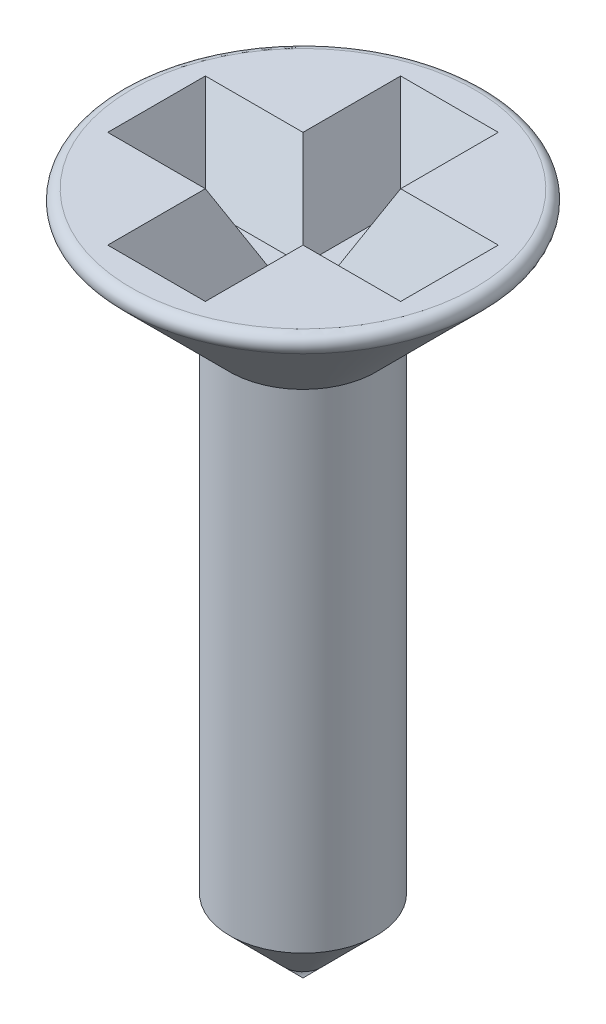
ISO-10303-21;
HEADER;
FILE_DESCRIPTION(('STEP AP214'),'2;1');
FILE_NAME('part.step','',(''),(''),'','','');
FILE_SCHEMA(('AUTOMOTIVE_DESIGN { 1 0 10303 214 1 1 1 1 }'));
ENDSEC;
DATA;
#1=APPLICATION_CONTEXT('core data for automotive mechanical design processes');
#2=APPLICATION_PROTOCOL_DEFINITION('international standard','automotive_design',2000,#1);
#3=PRODUCT_CONTEXT('',#1,'mechanical');
#4=PRODUCT('Part','Part','',(#3));
#5=PRODUCT_RELATED_PRODUCT_CATEGORY('part','',(#4));
#6=PRODUCT_DEFINITION_FORMATION('','',#4);
#7=PRODUCT_DEFINITION_CONTEXT('part definition',#1,'design');
#8=PRODUCT_DEFINITION('design','',#6,#7);
#9=PRODUCT_DEFINITION_SHAPE('','',#8);
#10=(LENGTH_UNIT() NAMED_UNIT(*) SI_UNIT(.MILLI.,.METRE.));
#11=(NAMED_UNIT(*) PLANE_ANGLE_UNIT() SI_UNIT($,.RADIAN.));
#12=(NAMED_UNIT(*) SI_UNIT($,.STERADIAN.) SOLID_ANGLE_UNIT());
#13=UNCERTAINTY_MEASURE_WITH_UNIT(LENGTH_MEASURE(1.E-05),#10,'distance_accuracy_value','');
#14=(GEOMETRIC_REPRESENTATION_CONTEXT(3) GLOBAL_UNCERTAINTY_ASSIGNED_CONTEXT((#13)) GLOBAL_UNIT_ASSIGNED_CONTEXT((#10,
#11,#12)) REPRESENTATION_CONTEXT('',''));
#15=CARTESIAN_POINT('',(0.,0.,0.));
#16=DIRECTION('',(0.,0.,1.));
#17=DIRECTION('',(1.,0.,0.));
#18=AXIS2_PLACEMENT_3D('',#15,#16,#17);
#19=CARTESIAN_POINT('',(-0.5,6.2,-1.5));
#20=DIRECTION('',(0.,-1.,0.));
#21=DIRECTION('',(0.,0.,-1.));
#22=AXIS2_PLACEMENT_3D('',#19,#20,#21);
#23=PLANE('',#22);
#24=DIRECTION('',(-1.,0.,0.));
#25=VECTOR('',#24,1.);
#26=CARTESIAN_POINT('',(1.5,6.2,0.126953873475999));
#27=LINE('',#26,#25);
#28=CARTESIAN_POINT('',(0.126953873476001,6.2,0.126953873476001));
#29=VERTEX_POINT('',#28);
#30=CARTESIAN_POINT('',(1.126953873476,6.2,0.126953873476));
#31=VERTEX_POINT('',#30);
#32=EDGE_CURVE('E207',#29,#31,#27,.F.);
#33=ORIENTED_EDGE('',*,*,#32,.T.);
#34=DIRECTION('',(0.,0.,1.));
#35=VECTOR('',#34,1.);
#36=CARTESIAN_POINT('',(1.126953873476,6.2,-0.500000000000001));
#37=LINE('',#36,#35);
#38=CARTESIAN_POINT('',(1.126953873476,6.2,-0.126953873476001));
#39=VERTEX_POINT('',#38);
#40=EDGE_CURVE('E11',#31,#39,#37,.F.);
#41=ORIENTED_EDGE('',*,*,#40,.T.);
#42=DIRECTION('',(1.,0.,0.));
#43=VECTOR('',#42,1.);
#44=CARTESIAN_POINT('',(0.499999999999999,6.2,-0.126953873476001));
#45=LINE('',#44,#43);
#46=CARTESIAN_POINT('',(0.126953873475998,6.2,-0.126953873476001));
#47=VERTEX_POINT('',#46);
#48=EDGE_CURVE('E211',#39,#47,#45,.F.);
#49=ORIENTED_EDGE('',*,*,#48,.T.);
#50=DIRECTION('',(0.,0.,1.));
#51=VECTOR('',#50,1.);
#52=CARTESIAN_POINT('',(0.126953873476,6.2,-1.5));
#53=LINE('',#52,#51);
#54=CARTESIAN_POINT('',(0.126953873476,6.2,-1.126953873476));
#55=VERTEX_POINT('',#54);
#56=EDGE_CURVE('E200',#47,#55,#53,.F.);
#57=ORIENTED_EDGE('',*,*,#56,.T.);
#58=DIRECTION('',(1.,0.,0.));
#59=VECTOR('',#58,1.);
#60=CARTESIAN_POINT('',(-0.5,6.2,-1.126953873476));
#61=LINE('',#60,#59);
#62=CARTESIAN_POINT('',(-0.126953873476,6.2,-1.126953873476));
#63=VERTEX_POINT('',#62);
#64=EDGE_CURVE('E34',#55,#63,#61,.F.);
#65=ORIENTED_EDGE('',*,*,#64,.T.);
#66=DIRECTION('',(0.,0.,-1.));
#67=VECTOR('',#66,1.);
#68=CARTESIAN_POINT('',(-0.126953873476,6.2,-0.500000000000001));
#69=LINE('',#68,#67);
#70=CARTESIAN_POINT('',(-0.126953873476,6.2,-0.126953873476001));
#71=VERTEX_POINT('',#70);
#72=EDGE_CURVE('E170',#63,#71,#69,.F.);
#73=ORIENTED_EDGE('',*,*,#72,.T.);
#74=DIRECTION('',(1.,0.,0.));
#75=VECTOR('',#74,1.);
#76=CARTESIAN_POINT('',(-1.5,6.2,-0.126953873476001));
#77=LINE('',#76,#75);
#78=CARTESIAN_POINT('',(-1.126953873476,6.2,-0.126953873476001));
#79=VERTEX_POINT('',#78);
#80=EDGE_CURVE('E218',#71,#79,#77,.F.);
#81=ORIENTED_EDGE('',*,*,#80,.T.);
#82=DIRECTION('',(0.,0.,-1.));
#83=VECTOR('',#82,1.);
#84=CARTESIAN_POINT('',(-1.126953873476,6.2,0.499999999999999));
#85=LINE('',#84,#83);
#86=CARTESIAN_POINT('',(-1.126953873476,6.2,0.126953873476));
#87=VERTEX_POINT('',#86);
#88=EDGE_CURVE('E49',#79,#87,#85,.F.);
#89=ORIENTED_EDGE('',*,*,#88,.T.);
#90=DIRECTION('',(-1.,0.,0.));
#91=VECTOR('',#90,1.);
#92=CARTESIAN_POINT('',(-0.499999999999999,6.2,0.126953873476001));
#93=LINE('',#92,#91);
#94=CARTESIAN_POINT('',(-0.126953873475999,6.2,0.126953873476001));
#95=VERTEX_POINT('',#94);
#96=EDGE_CURVE('E220',#87,#95,#93,.F.);
#97=ORIENTED_EDGE('',*,*,#96,.T.);
#98=DIRECTION('',(0.,0.,-1.));
#99=VECTOR('',#98,1.);
#100=CARTESIAN_POINT('',(-0.126953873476,6.2,1.5));
#101=LINE('',#100,#99);
#102=CARTESIAN_POINT('',(-0.126953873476,6.2,1.126953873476));
#103=VERTEX_POINT('',#102);
#104=EDGE_CURVE('E208',#95,#103,#101,.F.);
#105=ORIENTED_EDGE('',*,*,#104,.T.);
#106=DIRECTION('',(1.,0.,0.));
#107=VECTOR('',#106,1.);
#108=CARTESIAN_POINT('',(-0.5,6.2,1.126953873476));
#109=LINE('',#108,#107);
#110=CARTESIAN_POINT('',(0.126953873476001,6.2,1.126953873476));
#111=VERTEX_POINT('',#110);
#112=EDGE_CURVE('E41',#111,#103,#109,.F.);
#113=ORIENTED_EDGE('',*,*,#112,.F.);
#114=DIRECTION('',(0.,0.,1.));
#115=VECTOR('',#114,1.);
#116=CARTESIAN_POINT('',(0.126953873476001,6.2,0.5));
#117=LINE('',#116,#115);
#118=EDGE_CURVE('E204',#111,#29,#117,.F.);
#119=ORIENTED_EDGE('',*,*,#118,.T.);
#120=EDGE_LOOP('',(#33,#41,#49,#57,#65,#73,#81,#89,#97,#105,#113,#119));
#121=FACE_BOUND('',#120,.T.);
#122=ADVANCED_FACE('F26',(#121),#23,.F.);
#123=CARTESIAN_POINT('',(1.5,7.,-0.500000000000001));
#124=DIRECTION('',(-0.90630778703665,0.4226182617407,0.));
#125=DIRECTION('',(-0.4226182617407,-0.90630778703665,0.));
#126=AXIS2_PLACEMENT_3D('',#123,#124,#125);
#127=PLANE('',#126);
#128=ORIENTED_EDGE('',*,*,#40,.F.);
#129=DIRECTION('',(0.389281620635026,0.834817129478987,0.389281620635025));
#130=VECTOR('',#129,1.);
#131=CARTESIAN_POINT('',(1.5,7.,0.499999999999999));
#132=LINE('',#131,#130);
#133=CARTESIAN_POINT('',(1.5,7.,0.499999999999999));
#134=VERTEX_POINT('',#133);
#135=EDGE_CURVE('E191',#31,#134,#132,.T.);
#136=ORIENTED_EDGE('',*,*,#135,.T.);
#137=DIRECTION('',(0.,0.,-1.));
#138=VECTOR('',#137,1.);
#139=CARTESIAN_POINT('',(1.5,7.,-0.500000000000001));
#140=LINE('',#139,#138);
#141=CARTESIAN_POINT('',(1.5,7.,-0.500000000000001));
#142=VERTEX_POINT('',#141);
#143=EDGE_CURVE('E158',#134,#142,#140,.T.);
#144=ORIENTED_EDGE('',*,*,#143,.T.);
#145=DIRECTION('',(0.389281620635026,0.834817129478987,-0.389281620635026));
#146=VECTOR('',#145,1.);
#147=CARTESIAN_POINT('',(1.5,7.,-0.500000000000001));
#148=LINE('',#147,#146);
#149=EDGE_CURVE('E193',#39,#142,#148,.T.);
#150=ORIENTED_EDGE('',*,*,#149,.F.);
#151=EDGE_LOOP('',(#128,#136,#144,#150));
#152=FACE_BOUND('',#151,.T.);
#153=ADVANCED_FACE('F243',(#152),#127,.T.);
#154=CARTESIAN_POINT('',(-0.5,7.,-1.5));
#155=DIRECTION('',(0.,0.4226182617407,0.90630778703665));
#156=DIRECTION('',(0.,-0.90630778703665,0.4226182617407));
#157=AXIS2_PLACEMENT_3D('',#154,#155,#156);
#158=PLANE('',#157);
#159=ORIENTED_EDGE('',*,*,#64,.F.);
#160=DIRECTION('',(0.389281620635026,0.834817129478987,-0.389281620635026));
#161=VECTOR('',#160,1.);
#162=CARTESIAN_POINT('',(0.5,7.,-1.5));
#163=LINE('',#162,#161);
#164=CARTESIAN_POINT('',(0.5,7.,-1.5));
#165=VERTEX_POINT('',#164);
#166=EDGE_CURVE('E197',#55,#165,#163,.T.);
#167=ORIENTED_EDGE('',*,*,#166,.T.);
#168=DIRECTION('',(-1.,0.,0.));
#169=VECTOR('',#168,1.);
#170=CARTESIAN_POINT('',(-0.5,7.,-1.5));
#171=LINE('',#170,#169);
#172=CARTESIAN_POINT('',(-0.5,7.,-1.5));
#173=VERTEX_POINT('',#172);
#174=EDGE_CURVE('E167',#165,#173,#171,.T.);
#175=ORIENTED_EDGE('',*,*,#174,.T.);
#176=DIRECTION('',(-0.389281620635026,0.834817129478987,-0.389281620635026));
#177=VECTOR('',#176,1.);
#178=CARTESIAN_POINT('',(-0.5,7.,-1.5));
#179=LINE('',#178,#177);
#180=EDGE_CURVE('E175',#63,#173,#179,.T.);
#181=ORIENTED_EDGE('',*,*,#180,.F.);
#182=EDGE_LOOP('',(#159,#167,#175,#181));
#183=FACE_BOUND('',#182,.T.);
#184=ADVANCED_FACE('F228',(#183),#158,.T.);
#185=CARTESIAN_POINT('',(-1.5,7.,0.499999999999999));
#186=DIRECTION('',(0.90630778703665,0.4226182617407,0.));
#187=DIRECTION('',(-0.4226182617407,0.90630778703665,0.));
#188=AXIS2_PLACEMENT_3D('',#185,#186,#187);
#189=PLANE('',#188);
#190=ORIENTED_EDGE('',*,*,#88,.F.);
#191=DIRECTION('',(-0.389281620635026,0.834817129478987,-0.389281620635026));
#192=VECTOR('',#191,1.);
#193=CARTESIAN_POINT('',(-1.5,7.,-0.500000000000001));
#194=LINE('',#193,#192);
#195=CARTESIAN_POINT('',(-1.5,7.,-0.500000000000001));
#196=VERTEX_POINT('',#195);
#197=EDGE_CURVE('E118',#79,#196,#194,.T.);
#198=ORIENTED_EDGE('',*,*,#197,.T.);
#199=DIRECTION('',(0.,0.,1.));
#200=VECTOR('',#199,1.);
#201=CARTESIAN_POINT('',(-1.5,7.,0.499999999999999));
#202=LINE('',#201,#200);
#203=CARTESIAN_POINT('',(-1.5,7.,0.499999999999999));
#204=VERTEX_POINT('',#203);
#205=EDGE_CURVE('E122',#196,#204,#202,.T.);
#206=ORIENTED_EDGE('',*,*,#205,.T.);
#207=DIRECTION('',(-0.389281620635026,0.834817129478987,0.389281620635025));
#208=VECTOR('',#207,1.);
#209=CARTESIAN_POINT('',(-1.5,7.,0.499999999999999));
#210=LINE('',#209,#208);
#211=EDGE_CURVE('E125',#87,#204,#210,.T.);
#212=ORIENTED_EDGE('',*,*,#211,.F.);
#213=EDGE_LOOP('',(#190,#198,#206,#212));
#214=FACE_BOUND('',#213,.T.);
#215=ADVANCED_FACE('F120',(#214),#189,.T.);
#216=CARTESIAN_POINT('',(0.5,7.,1.5));
#217=DIRECTION('',(0.,0.4226182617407,-0.90630778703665));
#218=DIRECTION('',(0.,0.90630778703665,0.4226182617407));
#219=AXIS2_PLACEMENT_3D('',#216,#217,#218);
#220=PLANE('',#219);
#221=DIRECTION('',(0.389281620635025,0.834817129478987,0.389281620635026));
#222=VECTOR('',#221,1.);
#223=CARTESIAN_POINT('',(0.5,7.,1.5));
#224=LINE('',#223,#222);
#225=CARTESIAN_POINT('',(0.5,7.,1.5));
#226=VERTEX_POINT('',#225);
#227=EDGE_CURVE('E186',#111,#226,#224,.T.);
#228=ORIENTED_EDGE('',*,*,#227,.F.);
#229=ORIENTED_EDGE('',*,*,#112,.T.);
#230=DIRECTION('',(-0.389281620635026,0.834817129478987,0.389281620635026));
#231=VECTOR('',#230,1.);
#232=CARTESIAN_POINT('',(-0.5,7.,1.5));
#233=LINE('',#232,#231);
#234=CARTESIAN_POINT('',(-0.5,7.,1.5));
#235=VERTEX_POINT('',#234);
#236=EDGE_CURVE('E184',#103,#235,#233,.T.);
#237=ORIENTED_EDGE('',*,*,#236,.T.);
#238=DIRECTION('',(1.,0.,0.));
#239=VECTOR('',#238,1.);
#240=CARTESIAN_POINT('',(0.5,7.,1.5));
#241=LINE('',#240,#239);
#242=EDGE_CURVE('E149',#235,#226,#241,.T.);
#243=ORIENTED_EDGE('',*,*,#242,.T.);
#244=EDGE_LOOP('',(#228,#229,#237,#243));
#245=FACE_BOUND('',#244,.T.);
#246=ADVANCED_FACE('F254',(#245),#220,.T.);
#247=CARTESIAN_POINT('',(0.,0.,0.));
#248=DIRECTION('',(0.,1.,0.));
#249=DIRECTION('',(-1.,0.,0.));
#250=AXIS2_PLACEMENT_3D('',#247,#248,#249);
#251=CONICAL_SURFACE('',#250,0.,0.78539816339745);
#252=CARTESIAN_POINT('',(0.,0.749999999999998,0.));
#253=DIRECTION('',(0.,1.,0.));
#254=DIRECTION('',(-1.,0.,0.));
#255=AXIS2_PLACEMENT_3D('',#252,#253,#254);
#256=CIRCLE('',#255,0.750000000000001);
#257=CARTESIAN_POINT('',(-0.750000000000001,0.749999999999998,0.));
#258=VERTEX_POINT('',#257);
#259=EDGE_CURVE('E174',#258,#258,#256,.T.);
#260=ORIENTED_EDGE('',*,*,#259,.F.);
#261=EDGE_LOOP('',(#260));
#262=FACE_BOUND('',#261,.T.);
#263=CARTESIAN_POINT('',(0.,0.,0.));
#264=VERTEX_POINT('',#263);
#265=VERTEX_LOOP('',#264);
#266=FACE_BOUND('',#265,.T.);
#267=ADVANCED_FACE('F288',(#262,#266),#251,.T.);
#268=CARTESIAN_POINT('',(0.,7.,0.));
#269=DIRECTION('',(0.,1.,0.));
#270=DIRECTION('',(-1.,0.,0.));
#271=AXIS2_PLACEMENT_3D('',#268,#269,#270);
#272=CYLINDRICAL_SURFACE('',#271,0.750000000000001);
#273=CARTESIAN_POINT('',(0.,5.75000000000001,0.));
#274=DIRECTION('',(0.,1.,0.));
#275=DIRECTION('',(-1.,0.,0.));
#276=AXIS2_PLACEMENT_3D('',#273,#274,#275);
#277=CIRCLE('',#276,0.75);
#278=CARTESIAN_POINT('',(-0.750000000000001,5.75000000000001,0.));
#279=VERTEX_POINT('',#278);
#280=EDGE_CURVE('E171',#279,#279,#277,.T.);
#281=ORIENTED_EDGE('',*,*,#280,.F.);
#282=EDGE_LOOP('',(#281));
#283=FACE_BOUND('',#282,.T.);
#284=ORIENTED_EDGE('',*,*,#259,.T.);
#285=EDGE_LOOP('',(#284));
#286=FACE_BOUND('',#285,.T.);
#287=ADVANCED_FACE('F284',(#283,#286),#272,.T.);
#288=CARTESIAN_POINT('',(0.,5.75000000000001,0.));
#289=DIRECTION('',(0.,1.,0.));
#290=DIRECTION('',(-1.,0.,0.));
#291=AXIS2_PLACEMENT_3D('',#288,#289,#290);
#292=CONICAL_SURFACE('',#291,0.750000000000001,0.785398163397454);
#293=CARTESIAN_POINT('',(0.,6.82928932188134,0.));
#294=DIRECTION('',(0.,-1.,0.));
#295=DIRECTION('',(1.,0.,0.));
#296=AXIS2_PLACEMENT_3D('',#293,#294,#295);
#297=CIRCLE('',#296,1.82928932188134);
#298=CARTESIAN_POINT('',(1.82928932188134,6.82928932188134,0.));
#299=VERTEX_POINT('',#298);
#300=EDGE_CURVE('E181',#299,#299,#297,.T.);
#301=ORIENTED_EDGE('',*,*,#300,.T.);
#302=EDGE_LOOP('',(#301));
#303=FACE_BOUND('',#302,.T.);
#304=ORIENTED_EDGE('',*,*,#280,.T.);
#305=EDGE_LOOP('',(#304));
#306=FACE_BOUND('',#305,.T.);
#307=ADVANCED_FACE('F281',(#303,#306),#292,.T.);
#308=CARTESIAN_POINT('',(0.,7.,0.));
#309=DIRECTION('',(0.,-1.,0.));
#310=DIRECTION('',(1.,0.,0.));
#311=AXIS2_PLACEMENT_3D('',#308,#309,#310);
#312=PLANE('',#311);
#313=DIRECTION('',(-1.,0.,0.));
#314=VECTOR('',#313,1.);
#315=CARTESIAN_POINT('',(-1.5,7.,-0.500000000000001));
#316=LINE('',#315,#314);
#317=CARTESIAN_POINT('',(-0.5,7.,-0.500000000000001));
#318=VERTEX_POINT('',#317);
#319=EDGE_CURVE('E130',#318,#196,#316,.T.);
#320=ORIENTED_EDGE('',*,*,#319,.F.);
#321=DIRECTION('',(0.,0.,1.));
#322=VECTOR('',#321,1.);
#323=CARTESIAN_POINT('',(-0.5,7.,-0.500000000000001));
#324=LINE('',#323,#322);
#325=EDGE_CURVE('E135',#173,#318,#324,.T.);
#326=ORIENTED_EDGE('',*,*,#325,.F.);
#327=ORIENTED_EDGE('',*,*,#174,.F.);
#328=DIRECTION('',(0.,0.,-1.));
#329=VECTOR('',#328,1.);
#330=CARTESIAN_POINT('',(0.5,7.,-1.5));
#331=LINE('',#330,#329);
#332=CARTESIAN_POINT('',(0.499999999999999,7.,-0.500000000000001));
#333=VERTEX_POINT('',#332);
#334=EDGE_CURVE('E164',#333,#165,#331,.T.);
#335=ORIENTED_EDGE('',*,*,#334,.F.);
#336=DIRECTION('',(-1.,0.,0.));
#337=VECTOR('',#336,1.);
#338=CARTESIAN_POINT('',(0.499999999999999,7.,-0.500000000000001));
#339=LINE('',#338,#337);
#340=EDGE_CURVE('E161',#142,#333,#339,.T.);
#341=ORIENTED_EDGE('',*,*,#340,.F.);
#342=ORIENTED_EDGE('',*,*,#143,.F.);
#343=DIRECTION('',(1.,0.,0.));
#344=VECTOR('',#343,1.);
#345=CARTESIAN_POINT('',(1.5,7.,0.499999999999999));
#346=LINE('',#345,#344);
#347=CARTESIAN_POINT('',(0.500000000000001,7.,0.500000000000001));
#348=VERTEX_POINT('',#347);
#349=EDGE_CURVE('E155',#348,#134,#346,.T.);
#350=ORIENTED_EDGE('',*,*,#349,.F.);
#351=DIRECTION('',(0.,0.,-1.));
#352=VECTOR('',#351,1.);
#353=CARTESIAN_POINT('',(0.500000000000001,7.,0.500000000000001));
#354=LINE('',#353,#352);
#355=EDGE_CURVE('E152',#226,#348,#354,.T.);
#356=ORIENTED_EDGE('',*,*,#355,.F.);
#357=ORIENTED_EDGE('',*,*,#242,.F.);
#358=DIRECTION('',(0.,0.,1.));
#359=VECTOR('',#358,1.);
#360=CARTESIAN_POINT('',(-0.5,7.,1.5));
#361=LINE('',#360,#359);
#362=CARTESIAN_POINT('',(-0.499999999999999,7.,0.500000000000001));
#363=VERTEX_POINT('',#362);
#364=EDGE_CURVE('E143',#363,#235,#361,.T.);
#365=ORIENTED_EDGE('',*,*,#364,.F.);
#366=DIRECTION('',(1.,0.,0.));
#367=VECTOR('',#366,1.);
#368=CARTESIAN_POINT('',(-0.499999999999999,7.,0.500000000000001));
#369=LINE('',#368,#367);
#370=EDGE_CURVE('E141',#204,#363,#369,.T.);
#371=ORIENTED_EDGE('',*,*,#370,.F.);
#372=ORIENTED_EDGE('',*,*,#205,.F.);
#373=EDGE_LOOP('',(#320,#326,#327,#335,#341,#342,#350,#356,#357,#365,#371,#372));
#374=FACE_BOUND('',#373,.T.);
#375=CARTESIAN_POINT('',(0.,7.,0.));
#376=DIRECTION('',(0.,-1.,0.));
#377=DIRECTION('',(1.,0.,0.));
#378=AXIS2_PLACEMENT_3D('',#375,#376,#377);
#379=CIRCLE('',#378,1.75857864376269);
#380=CARTESIAN_POINT('',(1.75857864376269,7.,0.));
#381=VERTEX_POINT('',#380);
#382=EDGE_CURVE('E178',#381,#381,#379,.F.);
#383=ORIENTED_EDGE('',*,*,#382,.T.);
#384=EDGE_LOOP('',(#383));
#385=FACE_BOUND('',#384,.T.);
#386=ADVANCED_FACE('F137',(#374,#385),#312,.F.);
#387=CARTESIAN_POINT('',(0.,6.9,0.));
#388=DIRECTION('',(0.,-1.,0.));
#389=DIRECTION('',(1.,0.,0.));
#390=AXIS2_PLACEMENT_3D('',#387,#388,#389);
#391=TOROIDAL_SURFACE('',#390,1.75857864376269,0.1);
#392=ORIENTED_EDGE('',*,*,#300,.F.);
#393=EDGE_LOOP('',(#392));
#394=FACE_BOUND('',#393,.T.);
#395=ORIENTED_EDGE('',*,*,#382,.F.);
#396=EDGE_LOOP('',(#395));
#397=FACE_BOUND('',#396,.T.);
#398=ADVANCED_FACE('F276',(#394,#397),#391,.T.);
#399=CARTESIAN_POINT('',(-0.5,7.,-0.500000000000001));
#400=DIRECTION('',(0.90630778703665,0.4226182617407,0.));
#401=DIRECTION('',(-0.4226182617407,0.90630778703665,0.));
#402=AXIS2_PLACEMENT_3D('',#399,#400,#401);
#403=PLANE('',#402);
#404=ORIENTED_EDGE('',*,*,#72,.F.);
#405=ORIENTED_EDGE('',*,*,#180,.T.);
#406=ORIENTED_EDGE('',*,*,#325,.T.);
#407=DIRECTION('',(-0.389281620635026,0.834817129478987,-0.389281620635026));
#408=VECTOR('',#407,1.);
#409=CARTESIAN_POINT('',(-0.651540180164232,7.32497896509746,-0.651540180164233));
#410=LINE('',#409,#408);
#411=EDGE_CURVE('E126',#71,#318,#410,.T.);
#412=ORIENTED_EDGE('',*,*,#411,.F.);
#413=EDGE_LOOP('',(#404,#405,#406,#412));
#414=FACE_BOUND('',#413,.T.);
#415=ADVANCED_FACE('F231',(#414),#403,.T.);
#416=CARTESIAN_POINT('',(0.5,7.,-1.5));
#417=DIRECTION('',(-0.90630778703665,0.4226182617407,0.));
#418=DIRECTION('',(-0.4226182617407,-0.90630778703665,0.));
#419=AXIS2_PLACEMENT_3D('',#416,#417,#418);
#420=PLANE('',#419);
#421=ORIENTED_EDGE('',*,*,#166,.F.);
#422=ORIENTED_EDGE('',*,*,#56,.F.);
#423=DIRECTION('',(0.389281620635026,0.834817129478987,-0.389281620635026));
#424=VECTOR('',#423,1.);
#425=CARTESIAN_POINT('',(0.651540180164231,7.32497896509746,-0.651540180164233));
#426=LINE('',#425,#424);
#427=EDGE_CURVE('E195',#47,#333,#426,.T.);
#428=ORIENTED_EDGE('',*,*,#427,.T.);
#429=ORIENTED_EDGE('',*,*,#334,.T.);
#430=EDGE_LOOP('',(#421,#422,#428,#429));
#431=FACE_BOUND('',#430,.T.);
#432=ADVANCED_FACE('F236',(#431),#420,.T.);
#433=CARTESIAN_POINT('',(0.499999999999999,7.,-0.500000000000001));
#434=DIRECTION('',(0.,0.4226182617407,0.90630778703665));
#435=DIRECTION('',(0.,-0.90630778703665,0.4226182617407));
#436=AXIS2_PLACEMENT_3D('',#433,#434,#435);
#437=PLANE('',#436);
#438=ORIENTED_EDGE('',*,*,#48,.F.);
#439=ORIENTED_EDGE('',*,*,#149,.T.);
#440=ORIENTED_EDGE('',*,*,#340,.T.);
#441=ORIENTED_EDGE('',*,*,#427,.F.);
#442=EDGE_LOOP('',(#438,#439,#440,#441));
#443=FACE_BOUND('',#442,.T.);
#444=ADVANCED_FACE('F240',(#443),#437,.T.);
#445=CARTESIAN_POINT('',(1.5,7.,0.499999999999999));
#446=DIRECTION('',(0.,0.4226182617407,-0.90630778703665));
#447=DIRECTION('',(0.,0.90630778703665,0.4226182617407));
#448=AXIS2_PLACEMENT_3D('',#445,#446,#447);
#449=PLANE('',#448);
#450=ORIENTED_EDGE('',*,*,#135,.F.);
#451=ORIENTED_EDGE('',*,*,#32,.F.);
#452=DIRECTION('',(0.389281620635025,0.834817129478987,0.389281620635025));
#453=VECTOR('',#452,1.);
#454=CARTESIAN_POINT('',(0.651540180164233,7.32497896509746,0.651540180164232));
#455=LINE('',#454,#453);
#456=EDGE_CURVE('E189',#29,#348,#455,.T.);
#457=ORIENTED_EDGE('',*,*,#456,.T.);
#458=ORIENTED_EDGE('',*,*,#349,.T.);
#459=EDGE_LOOP('',(#450,#451,#457,#458));
#460=FACE_BOUND('',#459,.T.);
#461=ADVANCED_FACE('F249',(#460),#449,.T.);
#462=CARTESIAN_POINT('',(0.500000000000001,7.,0.500000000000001));
#463=DIRECTION('',(-0.90630778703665,0.4226182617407,0.));
#464=DIRECTION('',(-0.4226182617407,-0.90630778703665,0.));
#465=AXIS2_PLACEMENT_3D('',#462,#463,#464);
#466=PLANE('',#465);
#467=ORIENTED_EDGE('',*,*,#118,.F.);
#468=ORIENTED_EDGE('',*,*,#227,.T.);
#469=ORIENTED_EDGE('',*,*,#355,.T.);
#470=ORIENTED_EDGE('',*,*,#456,.F.);
#471=EDGE_LOOP('',(#467,#468,#469,#470));
#472=FACE_BOUND('',#471,.T.);
#473=ADVANCED_FACE('F253',(#472),#466,.T.);
#474=CARTESIAN_POINT('',(-0.5,7.,1.5));
#475=DIRECTION('',(0.90630778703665,0.4226182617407,0.));
#476=DIRECTION('',(-0.4226182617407,0.90630778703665,0.));
#477=AXIS2_PLACEMENT_3D('',#474,#475,#476);
#478=PLANE('',#477);
#479=ORIENTED_EDGE('',*,*,#236,.F.);
#480=ORIENTED_EDGE('',*,*,#104,.F.);
#481=DIRECTION('',(-0.389281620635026,0.834817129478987,0.389281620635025));
#482=VECTOR('',#481,1.);
#483=CARTESIAN_POINT('',(-0.651540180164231,7.32497896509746,0.651540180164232));
#484=LINE('',#483,#482);
#485=EDGE_CURVE('E187',#95,#363,#484,.T.);
#486=ORIENTED_EDGE('',*,*,#485,.T.);
#487=ORIENTED_EDGE('',*,*,#364,.T.);
#488=EDGE_LOOP('',(#479,#480,#486,#487));
#489=FACE_BOUND('',#488,.T.);
#490=ADVANCED_FACE('F28',(#489),#478,.T.);
#491=CARTESIAN_POINT('',(-0.499999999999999,7.,0.500000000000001));
#492=DIRECTION('',(0.,0.4226182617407,-0.90630778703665));
#493=DIRECTION('',(0.,0.90630778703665,0.4226182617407));
#494=AXIS2_PLACEMENT_3D('',#491,#492,#493);
#495=PLANE('',#494);
#496=ORIENTED_EDGE('',*,*,#96,.F.);
#497=ORIENTED_EDGE('',*,*,#211,.T.);
#498=ORIENTED_EDGE('',*,*,#370,.T.);
#499=ORIENTED_EDGE('',*,*,#485,.F.);
#500=EDGE_LOOP('',(#496,#497,#498,#499));
#501=FACE_BOUND('',#500,.T.);
#502=ADVANCED_FACE('F260',(#501),#495,.T.);
#503=CARTESIAN_POINT('',(-1.5,7.,-0.500000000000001));
#504=DIRECTION('',(0.,0.4226182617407,0.90630778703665));
#505=DIRECTION('',(0.,-0.90630778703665,0.4226182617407));
#506=AXIS2_PLACEMENT_3D('',#503,#504,#505);
#507=PLANE('',#506);
#508=ORIENTED_EDGE('',*,*,#197,.F.);
#509=ORIENTED_EDGE('',*,*,#80,.F.);
#510=ORIENTED_EDGE('',*,*,#411,.T.);
#511=ORIENTED_EDGE('',*,*,#319,.T.);
#512=EDGE_LOOP('',(#508,#509,#510,#511));
#513=FACE_BOUND('',#512,.T.);
#514=ADVANCED_FACE('F131',(#513),#507,.T.);
#515=CLOSED_SHELL('',(#122,#153,#184,#215,#246,#267,#287,#307,#386,#398,#415,#432,#444,#461,
#473,#490,#502,#514));
#516=MANIFOLD_SOLID_BREP('B2',#515);
#517=ADVANCED_BREP_SHAPE_REPRESENTATION('',(#18,#516),#14);
#518=SHAPE_DEFINITION_REPRESENTATION(#9,#517);
ENDSEC;
END-ISO-10303-21;
